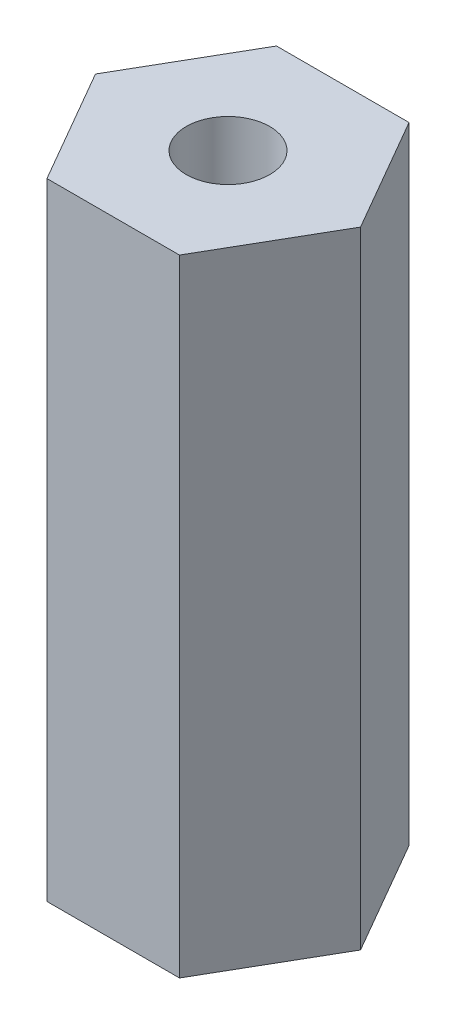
from build123d import *

# Parameters (mm, degrees)
SALIENTE_EXTRUIR1_DEPTH = 15
CROQUIS2_R              = 1
CORTAR_EXTRUIR1_DEPTH   = 16.577093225


with BuildPart() as part:
    # Croquis1 → Saliente-Extruir1 (new body)
    with BuildSketch(Plane(origin=(0, 0, 0), x_dir=(1, 0, 0), z_dir=(0, 1, 0))):
        Polygon((1.58771324, 2.75), (-1.58771324, 2.75), (-3.175426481, 0), (-1.58771324, -2.75), (1.58771324, -2.75), (3.175426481, 0), align=None)
    extrude(amount=SALIENTE_EXTRUIR1_DEPTH)

    # Croquis2 → Cortar-Extruir1 (cut, through all)
    with BuildSketch(Plane(origin=(0, 15, 0), x_dir=(1, 0, 0), z_dir=(0, 1, 0))):
        with Locations(Location((0, 0, 0), (0, 0, 270))):
            Circle(CROQUIS2_R)
    extrude(amount=-CORTAR_EXTRUIR1_DEPTH, mode=Mode.SUBTRACT)


solid = part.part
